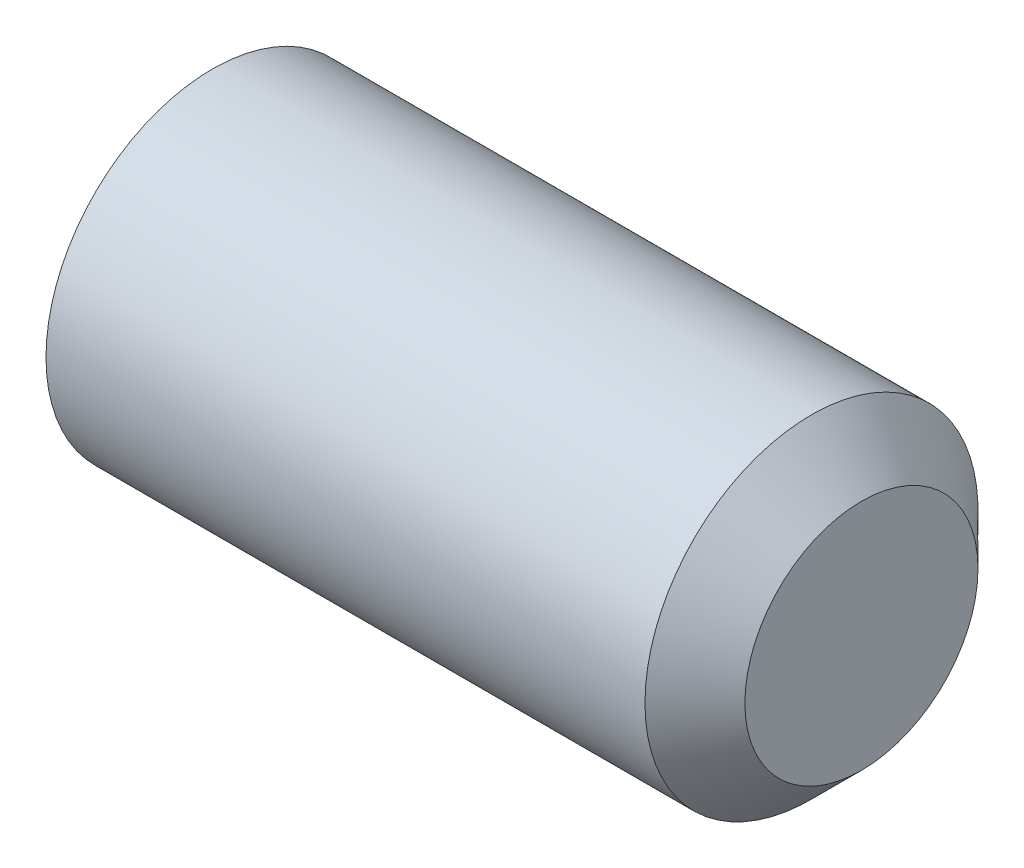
ISO-10303-21;
HEADER;
FILE_DESCRIPTION(('STEP AP214'),'2;1');
FILE_NAME('part.step','',(''),(''),'','','');
FILE_SCHEMA(('AUTOMOTIVE_DESIGN { 1 0 10303 214 1 1 1 1 }'));
ENDSEC;
DATA;
#1=APPLICATION_CONTEXT('core data for automotive mechanical design processes');
#2=APPLICATION_PROTOCOL_DEFINITION('international standard','automotive_design',2000,#1);
#3=PRODUCT_CONTEXT('',#1,'mechanical');
#4=PRODUCT('Part','Part','',(#3));
#5=PRODUCT_RELATED_PRODUCT_CATEGORY('part','',(#4));
#6=PRODUCT_DEFINITION_FORMATION('','',#4);
#7=PRODUCT_DEFINITION_CONTEXT('part definition',#1,'design');
#8=PRODUCT_DEFINITION('design','',#6,#7);
#9=PRODUCT_DEFINITION_SHAPE('','',#8);
#10=(LENGTH_UNIT() NAMED_UNIT(*) SI_UNIT(.MILLI.,.METRE.));
#11=(NAMED_UNIT(*) PLANE_ANGLE_UNIT() SI_UNIT($,.RADIAN.));
#12=(NAMED_UNIT(*) SI_UNIT($,.STERADIAN.) SOLID_ANGLE_UNIT());
#13=UNCERTAINTY_MEASURE_WITH_UNIT(LENGTH_MEASURE(1.E-05),#10,'distance_accuracy_value','');
#14=(GEOMETRIC_REPRESENTATION_CONTEXT(3) GLOBAL_UNCERTAINTY_ASSIGNED_CONTEXT((#13)) GLOBAL_UNIT_ASSIGNED_CONTEXT((#10,
#11,#12)) REPRESENTATION_CONTEXT('',''));
#15=CARTESIAN_POINT('',(0.,0.,0.));
#16=DIRECTION('',(0.,0.,1.));
#17=DIRECTION('',(1.,0.,0.));
#18=AXIS2_PLACEMENT_3D('',#15,#16,#17);
#19=CARTESIAN_POINT('',(0.,0.,0.));
#20=DIRECTION('',(-1.,0.,0.));
#21=DIRECTION('',(0.,0.,1.));
#22=AXIS2_PLACEMENT_3D('',#19,#20,#21);
#23=PLANE('',#22);
#24=CARTESIAN_POINT('',(0.,0.,0.));
#25=DIRECTION('',(-1.,0.,0.));
#26=DIRECTION('',(0.,0.,1.));
#27=AXIS2_PLACEMENT_3D('',#24,#25,#26);
#28=CIRCLE('',#27,2.055);
#29=CARTESIAN_POINT('',(0.,0.,2.055));
#30=VERTEX_POINT('',#29);
#31=EDGE_CURVE('E132',#30,#30,#28,.T.);
#32=ORIENTED_EDGE('',*,*,#31,.T.);
#33=EDGE_LOOP('',(#32));
#34=FACE_BOUND('',#33,.T.);
#35=DIRECTION('',(0.,0.,-1.));
#36=VECTOR('',#35,1.);
#37=CARTESIAN_POINT('',(0.,1.25,0.72168783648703));
#38=LINE('',#37,#36);
#39=CARTESIAN_POINT('',(0.,1.25,0.72168783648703));
#40=VERTEX_POINT('',#39);
#41=CARTESIAN_POINT('',(0.,1.25,-0.721687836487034));
#42=VERTEX_POINT('',#41);
#43=EDGE_CURVE('E123',#40,#42,#38,.T.);
#44=ORIENTED_EDGE('',*,*,#43,.F.);
#45=DIRECTION('',(0.,-0.866025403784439,0.5));
#46=VECTOR('',#45,1.);
#47=CARTESIAN_POINT('',(0.,1.25,0.72168783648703));
#48=LINE('',#47,#46);
#49=CARTESIAN_POINT('',(0.,0.,1.44337567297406));
#50=VERTEX_POINT('',#49);
#51=EDGE_CURVE('E45',#40,#50,#48,.T.);
#52=ORIENTED_EDGE('',*,*,#51,.T.);
#53=DIRECTION('',(0.,0.866025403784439,0.5));
#54=VECTOR('',#53,1.);
#55=CARTESIAN_POINT('',(0.,-1.25,0.72168783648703));
#56=LINE('',#55,#54);
#57=CARTESIAN_POINT('',(0.,-1.25,0.72168783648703));
#58=VERTEX_POINT('',#57);
#59=EDGE_CURVE('E114',#58,#50,#56,.T.);
#60=ORIENTED_EDGE('',*,*,#59,.F.);
#61=DIRECTION('',(0.,0.,-1.));
#62=VECTOR('',#61,1.);
#63=CARTESIAN_POINT('',(0.,-1.25,0.72168783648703));
#64=LINE('',#63,#62);
#65=CARTESIAN_POINT('',(0.,-1.25,-0.721687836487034));
#66=VERTEX_POINT('',#65);
#67=EDGE_CURVE('E117',#58,#66,#64,.T.);
#68=ORIENTED_EDGE('',*,*,#67,.T.);
#69=DIRECTION('',(0.,0.866025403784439,-0.5));
#70=VECTOR('',#69,1.);
#71=CARTESIAN_POINT('',(0.,-1.25,-0.721687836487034));
#72=LINE('',#71,#70);
#73=CARTESIAN_POINT('',(0.,0.,-1.44337567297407));
#74=VERTEX_POINT('',#73);
#75=EDGE_CURVE('E120',#66,#74,#72,.T.);
#76=ORIENTED_EDGE('',*,*,#75,.T.);
#77=DIRECTION('',(0.,-0.866025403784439,-0.5));
#78=VECTOR('',#77,1.);
#79=CARTESIAN_POINT('',(0.,1.25,-0.721687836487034));
#80=LINE('',#79,#78);
#81=EDGE_CURVE('E103',#42,#74,#80,.T.);
#82=ORIENTED_EDGE('',*,*,#81,.F.);
#83=EDGE_LOOP('',(#44,#52,#60,#68,#76,#82));
#84=FACE_BOUND('',#83,.T.);
#85=ADVANCED_FACE('F30',(#34,#84),#23,.T.);
#86=CARTESIAN_POINT('',(10.,1.75,0.));
#87=DIRECTION('',(1.,0.,0.));
#88=DIRECTION('',(0.,0.,-1.));
#89=AXIS2_PLACEMENT_3D('',#86,#87,#88);
#90=PLANE('',#89);
#91=CARTESIAN_POINT('',(10.,0.,0.));
#92=DIRECTION('',(-1.,0.,0.));
#93=DIRECTION('',(0.,0.,1.));
#94=AXIS2_PLACEMENT_3D('',#91,#92,#93);
#95=CIRCLE('',#94,1.75);
#96=CARTESIAN_POINT('',(10.,0.,1.75));
#97=VERTEX_POINT('',#96);
#98=EDGE_CURVE('E11',#97,#97,#95,.T.);
#99=ORIENTED_EDGE('',*,*,#98,.F.);
#100=EDGE_LOOP('',(#99));
#101=FACE_BOUND('',#100,.T.);
#102=ADVANCED_FACE('F32',(#101),#90,.T.);
#103=CARTESIAN_POINT('',(9.25000000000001,0.,0.));
#104=DIRECTION('',(-1.,0.,0.));
#105=DIRECTION('',(0.,0.,1.));
#106=AXIS2_PLACEMENT_3D('',#103,#104,#105);
#107=CONICAL_SURFACE('',#106,2.5,0.785398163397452);
#108=ORIENTED_EDGE('',*,*,#98,.T.);
#109=EDGE_LOOP('',(#108));
#110=FACE_BOUND('',#109,.T.);
#111=CARTESIAN_POINT('',(9.25000000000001,0.,0.));
#112=DIRECTION('',(-1.,0.,0.));
#113=DIRECTION('',(0.,0.,1.));
#114=AXIS2_PLACEMENT_3D('',#111,#112,#113);
#115=CIRCLE('',#114,2.5);
#116=CARTESIAN_POINT('',(9.25000000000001,0.,2.5));
#117=VERTEX_POINT('',#116);
#118=EDGE_CURVE('E38',#117,#117,#115,.T.);
#119=ORIENTED_EDGE('',*,*,#118,.F.);
#120=EDGE_LOOP('',(#119));
#121=FACE_BOUND('',#120,.T.);
#122=ADVANCED_FACE('F143',(#110,#121),#107,.T.);
#123=CARTESIAN_POINT('',(-12.7,0.,0.));
#124=DIRECTION('',(-1.,0.,0.));
#125=DIRECTION('',(0.,0.,1.));
#126=AXIS2_PLACEMENT_3D('',#123,#124,#125);
#127=CYLINDRICAL_SURFACE('',#126,2.5);
#128=ORIENTED_EDGE('',*,*,#118,.T.);
#129=EDGE_LOOP('',(#128));
#130=FACE_BOUND('',#129,.T.);
#131=CARTESIAN_POINT('',(0.256920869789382,0.,0.));
#132=DIRECTION('',(-1.,0.,0.));
#133=DIRECTION('',(0.,0.,1.));
#134=AXIS2_PLACEMENT_3D('',#131,#132,#133);
#135=CIRCLE('',#134,2.5);
#136=CARTESIAN_POINT('',(0.256920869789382,0.,2.5));
#137=VERTEX_POINT('',#136);
#138=EDGE_CURVE('E135',#137,#137,#135,.T.);
#139=ORIENTED_EDGE('',*,*,#138,.F.);
#140=EDGE_LOOP('',(#139));
#141=FACE_BOUND('',#140,.T.);
#142=ADVANCED_FACE('F140',(#130,#141),#127,.T.);
#143=CARTESIAN_POINT('',(0.,0.,0.));
#144=DIRECTION('',(1.,0.,0.));
#145=DIRECTION('',(0.,0.,-1.));
#146=AXIS2_PLACEMENT_3D('',#143,#144,#145);
#147=CONICAL_SURFACE('',#146,2.055,1.0471975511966);
#148=ORIENTED_EDGE('',*,*,#138,.T.);
#149=EDGE_LOOP('',(#148));
#150=FACE_BOUND('',#149,.T.);
#151=ORIENTED_EDGE('',*,*,#31,.F.);
#152=EDGE_LOOP('',(#151));
#153=FACE_BOUND('',#152,.T.);
#154=ADVANCED_FACE('F150',(#150,#153),#147,.T.);
#155=CARTESIAN_POINT('',(3.,1.25,0.72168783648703));
#156=DIRECTION('',(0.,-0.5,-0.866025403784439));
#157=DIRECTION('',(0.,0.866025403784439,-0.5));
#158=AXIS2_PLACEMENT_3D('',#155,#156,#157);
#159=PLANE('',#158);
#160=ORIENTED_EDGE('',*,*,#51,.F.);
#161=DIRECTION('',(-1.,0.,0.));
#162=VECTOR('',#161,1.);
#163=CARTESIAN_POINT('',(3.,1.25,0.72168783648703));
#164=LINE('',#163,#162);
#165=CARTESIAN_POINT('',(3.,1.25,0.72168783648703));
#166=VERTEX_POINT('',#165);
#167=EDGE_CURVE('E50',#166,#40,#164,.T.);
#168=ORIENTED_EDGE('',*,*,#167,.F.);
#169=DIRECTION('',(0.,-0.866025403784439,0.5));
#170=VECTOR('',#169,1.);
#171=CARTESIAN_POINT('',(3.,1.25,0.72168783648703));
#172=LINE('',#171,#170);
#173=CARTESIAN_POINT('',(3.,0.,1.44337567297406));
#174=VERTEX_POINT('',#173);
#175=EDGE_CURVE('E77',#166,#174,#172,.T.);
#176=ORIENTED_EDGE('',*,*,#175,.T.);
#177=DIRECTION('',(-1.,0.,0.));
#178=VECTOR('',#177,1.);
#179=CARTESIAN_POINT('',(3.,0.,1.44337567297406));
#180=LINE('',#179,#178);
#181=EDGE_CURVE('E130',#174,#50,#180,.T.);
#182=ORIENTED_EDGE('',*,*,#181,.T.);
#183=EDGE_LOOP('',(#160,#168,#176,#182));
#184=FACE_BOUND('',#183,.T.);
#185=ADVANCED_FACE('F161',(#184),#159,.T.);
#186=CARTESIAN_POINT('',(3.,-1.25,0.72168783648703));
#187=DIRECTION('',(0.,-0.5,0.866025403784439));
#188=DIRECTION('',(0.,-0.866025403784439,-0.5));
#189=AXIS2_PLACEMENT_3D('',#186,#187,#188);
#190=PLANE('',#189);
#191=ORIENTED_EDGE('',*,*,#59,.T.);
#192=ORIENTED_EDGE('',*,*,#181,.F.);
#193=DIRECTION('',(0.,0.866025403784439,0.5));
#194=VECTOR('',#193,1.);
#195=CARTESIAN_POINT('',(3.,-1.25,0.72168783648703));
#196=LINE('',#195,#194);
#197=CARTESIAN_POINT('',(3.,-1.25,0.72168783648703));
#198=VERTEX_POINT('',#197);
#199=EDGE_CURVE('E259',#198,#174,#196,.T.);
#200=ORIENTED_EDGE('',*,*,#199,.F.);
#201=DIRECTION('',(-1.,0.,0.));
#202=VECTOR('',#201,1.);
#203=CARTESIAN_POINT('',(3.,-1.25,0.72168783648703));
#204=LINE('',#203,#202);
#205=EDGE_CURVE('E128',#198,#58,#204,.T.);
#206=ORIENTED_EDGE('',*,*,#205,.T.);
#207=EDGE_LOOP('',(#191,#192,#200,#206));
#208=FACE_BOUND('',#207,.T.);
#209=ADVANCED_FACE('F168',(#208),#190,.F.);
#210=CARTESIAN_POINT('',(3.,-1.25,0.72168783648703));
#211=DIRECTION('',(0.,1.,0.));
#212=DIRECTION('',(0.,0.,1.));
#213=AXIS2_PLACEMENT_3D('',#210,#211,#212);
#214=PLANE('',#213);
#215=ORIENTED_EDGE('',*,*,#67,.F.);
#216=ORIENTED_EDGE('',*,*,#205,.F.);
#217=DIRECTION('',(0.,0.,-1.));
#218=VECTOR('',#217,1.);
#219=CARTESIAN_POINT('',(3.,-1.25,0.72168783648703));
#220=LINE('',#219,#218);
#221=CARTESIAN_POINT('',(3.,-1.25,-0.721687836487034));
#222=VERTEX_POINT('',#221);
#223=EDGE_CURVE('E98',#198,#222,#220,.T.);
#224=ORIENTED_EDGE('',*,*,#223,.T.);
#225=DIRECTION('',(-1.,0.,0.));
#226=VECTOR('',#225,1.);
#227=CARTESIAN_POINT('',(3.,-1.25,-0.721687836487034));
#228=LINE('',#227,#226);
#229=EDGE_CURVE('E93',#222,#66,#228,.T.);
#230=ORIENTED_EDGE('',*,*,#229,.T.);
#231=EDGE_LOOP('',(#215,#216,#224,#230));
#232=FACE_BOUND('',#231,.T.);
#233=ADVANCED_FACE('F175',(#232),#214,.T.);
#234=CARTESIAN_POINT('',(3.,-1.25,-0.721687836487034));
#235=DIRECTION('',(0.,0.5,0.866025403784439));
#236=DIRECTION('',(0.,-0.866025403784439,0.5));
#237=AXIS2_PLACEMENT_3D('',#234,#235,#236);
#238=PLANE('',#237);
#239=ORIENTED_EDGE('',*,*,#75,.F.);
#240=ORIENTED_EDGE('',*,*,#229,.F.);
#241=DIRECTION('',(0.,0.866025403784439,-0.5));
#242=VECTOR('',#241,1.);
#243=CARTESIAN_POINT('',(3.,-1.25,-0.721687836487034));
#244=LINE('',#243,#242);
#245=CARTESIAN_POINT('',(3.,0.,-1.44337567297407));
#246=VERTEX_POINT('',#245);
#247=EDGE_CURVE('E88',#222,#246,#244,.T.);
#248=ORIENTED_EDGE('',*,*,#247,.T.);
#249=DIRECTION('',(-1.,0.,0.));
#250=VECTOR('',#249,1.);
#251=CARTESIAN_POINT('',(3.,0.,-1.44337567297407));
#252=LINE('',#251,#250);
#253=EDGE_CURVE('E92',#246,#74,#252,.T.);
#254=ORIENTED_EDGE('',*,*,#253,.T.);
#255=EDGE_LOOP('',(#239,#240,#248,#254));
#256=FACE_BOUND('',#255,.T.);
#257=ADVANCED_FACE('F91',(#256),#238,.T.);
#258=CARTESIAN_POINT('',(3.,1.25,-0.721687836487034));
#259=DIRECTION('',(0.,0.5,-0.866025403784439));
#260=DIRECTION('',(0.,0.866025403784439,0.5));
#261=AXIS2_PLACEMENT_3D('',#258,#259,#260);
#262=PLANE('',#261);
#263=ORIENTED_EDGE('',*,*,#81,.T.);
#264=ORIENTED_EDGE('',*,*,#253,.F.);
#265=DIRECTION('',(0.,-0.866025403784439,-0.5));
#266=VECTOR('',#265,1.);
#267=CARTESIAN_POINT('',(3.,1.25,-0.721687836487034));
#268=LINE('',#267,#266);
#269=CARTESIAN_POINT('',(3.,1.25,-0.721687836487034));
#270=VERTEX_POINT('',#269);
#271=EDGE_CURVE('E97',#270,#246,#268,.T.);
#272=ORIENTED_EDGE('',*,*,#271,.F.);
#273=DIRECTION('',(-1.,0.,0.));
#274=VECTOR('',#273,1.);
#275=CARTESIAN_POINT('',(3.,1.25,-0.721687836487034));
#276=LINE('',#275,#274);
#277=EDGE_CURVE('E73',#270,#42,#276,.T.);
#278=ORIENTED_EDGE('',*,*,#277,.T.);
#279=EDGE_LOOP('',(#263,#264,#272,#278));
#280=FACE_BOUND('',#279,.T.);
#281=ADVANCED_FACE('F100',(#280),#262,.F.);
#282=CARTESIAN_POINT('',(3.,1.25,0.72168783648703));
#283=DIRECTION('',(0.,1.,0.));
#284=DIRECTION('',(0.,0.,1.));
#285=AXIS2_PLACEMENT_3D('',#282,#283,#284);
#286=PLANE('',#285);
#287=ORIENTED_EDGE('',*,*,#43,.T.);
#288=ORIENTED_EDGE('',*,*,#277,.F.);
#289=DIRECTION('',(0.,0.,-1.));
#290=VECTOR('',#289,1.);
#291=CARTESIAN_POINT('',(3.,1.25,0.72168783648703));
#292=LINE('',#291,#290);
#293=EDGE_CURVE('E108',#166,#270,#292,.T.);
#294=ORIENTED_EDGE('',*,*,#293,.F.);
#295=ORIENTED_EDGE('',*,*,#167,.T.);
#296=EDGE_LOOP('',(#287,#288,#294,#295));
#297=FACE_BOUND('',#296,.T.);
#298=ADVANCED_FACE('F187',(#297),#286,.F.);
#299=CARTESIAN_POINT('',(3.,1.25,0.72168783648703));
#300=DIRECTION('',(1.,0.,0.));
#301=DIRECTION('',(0.,0.,-1.));
#302=AXIS2_PLACEMENT_3D('',#299,#300,#301);
#303=PLANE('',#302);
#304=ORIENTED_EDGE('',*,*,#175,.F.);
#305=ORIENTED_EDGE('',*,*,#293,.T.);
#306=ORIENTED_EDGE('',*,*,#271,.T.);
#307=ORIENTED_EDGE('',*,*,#247,.F.);
#308=ORIENTED_EDGE('',*,*,#223,.F.);
#309=ORIENTED_EDGE('',*,*,#199,.T.);
#310=EDGE_LOOP('',(#304,#305,#306,#307,#308,#309));
#311=FACE_BOUND('',#310,.T.);
#312=ADVANCED_FACE('F106',(#311),#303,.F.);
#313=CLOSED_SHELL('',(#85,#102,#122,#142,#154,#185,#209,#233,#257,#281,#298,#312));
#314=MANIFOLD_SOLID_BREP('B2',#313);
#315=ADVANCED_BREP_SHAPE_REPRESENTATION('',(#18,#314),#14);
#316=SHAPE_DEFINITION_REPRESENTATION(#9,#315);
ENDSEC;
END-ISO-10303-21;
